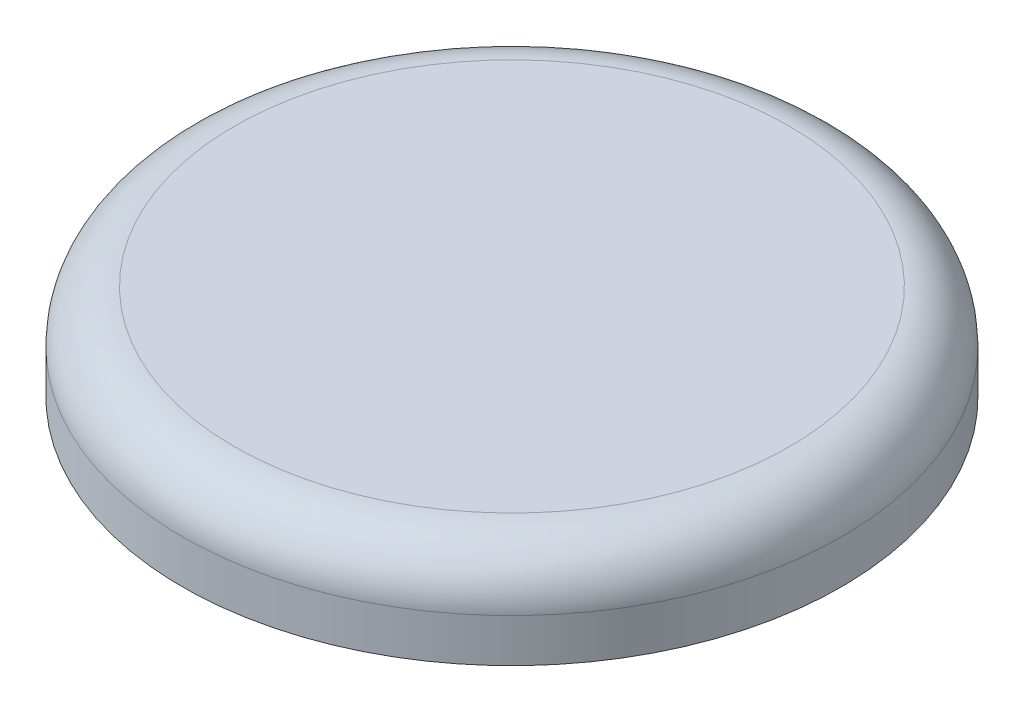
ISO-10303-21;
HEADER;
FILE_DESCRIPTION(('STEP AP214'),'2;1');
FILE_NAME('part.step','',(''),(''),'','','');
FILE_SCHEMA(('AUTOMOTIVE_DESIGN { 1 0 10303 214 1 1 1 1 }'));
ENDSEC;
DATA;
#1=APPLICATION_CONTEXT('core data for automotive mechanical design processes');
#2=APPLICATION_PROTOCOL_DEFINITION('international standard','automotive_design',2000,#1);
#3=PRODUCT_CONTEXT('',#1,'mechanical');
#4=PRODUCT('Part','Part','',(#3));
#5=PRODUCT_RELATED_PRODUCT_CATEGORY('part','',(#4));
#6=PRODUCT_DEFINITION_FORMATION('','',#4);
#7=PRODUCT_DEFINITION_CONTEXT('part definition',#1,'design');
#8=PRODUCT_DEFINITION('design','',#6,#7);
#9=PRODUCT_DEFINITION_SHAPE('','',#8);
#10=(LENGTH_UNIT() NAMED_UNIT(*) SI_UNIT(.MILLI.,.METRE.));
#11=(NAMED_UNIT(*) PLANE_ANGLE_UNIT() SI_UNIT($,.RADIAN.));
#12=(NAMED_UNIT(*) SI_UNIT($,.STERADIAN.) SOLID_ANGLE_UNIT());
#13=UNCERTAINTY_MEASURE_WITH_UNIT(LENGTH_MEASURE(1.E-05),#10,'distance_accuracy_value','');
#14=(GEOMETRIC_REPRESENTATION_CONTEXT(3) GLOBAL_UNCERTAINTY_ASSIGNED_CONTEXT((#13)) GLOBAL_UNIT_ASSIGNED_CONTEXT((#10,
#11,#12)) REPRESENTATION_CONTEXT('',''));
#15=CARTESIAN_POINT('',(0.,0.,0.));
#16=DIRECTION('',(0.,0.,1.));
#17=DIRECTION('',(1.,0.,0.));
#18=AXIS2_PLACEMENT_3D('',#15,#16,#17);
#19=CARTESIAN_POINT('',(0.,0.,0.));
#20=DIRECTION('',(0.,-1.,0.));
#21=DIRECTION('',(0.,0.,-1.));
#22=AXIS2_PLACEMENT_3D('',#19,#20,#21);
#23=PLANE('',#22);
#24=CARTESIAN_POINT('',(0.,0.,0.));
#25=DIRECTION('',(0.,-1.,0.));
#26=DIRECTION('',(0.,0.,-1.));
#27=AXIS2_PLACEMENT_3D('',#24,#25,#26);
#28=CIRCLE('',#27,16.288);
#29=CARTESIAN_POINT('',(0.,0.,-16.288));
#30=VERTEX_POINT('',#29);
#31=EDGE_CURVE('E57',#30,#30,#28,.F.);
#32=ORIENTED_EDGE('',*,*,#31,.T.);
#33=EDGE_LOOP('',(#32));
#34=FACE_BOUND('',#33,.T.);
#35=ADVANCED_FACE('F37',(#34),#23,.F.);
#36=CARTESIAN_POINT('',(0.,0.,0.));
#37=DIRECTION('',(0.,-1.,0.));
#38=DIRECTION('',(0.,0.,-1.));
#39=AXIS2_PLACEMENT_3D('',#36,#37,#38);
#40=CYLINDRICAL_SURFACE('',#39,19.342);
#41=CARTESIAN_POINT('',(0.,-3.054,0.));
#42=DIRECTION('',(0.,-1.,0.));
#43=DIRECTION('',(0.,0.,-1.));
#44=AXIS2_PLACEMENT_3D('',#41,#42,#43);
#45=CIRCLE('',#44,19.342);
#46=CARTESIAN_POINT('',(0.,-3.054,-19.342));
#47=VERTEX_POINT('',#46);
#48=EDGE_CURVE('E60',#47,#47,#45,.T.);
#49=ORIENTED_EDGE('',*,*,#48,.T.);
#50=EDGE_LOOP('',(#49));
#51=FACE_BOUND('',#50,.T.);
#52=CARTESIAN_POINT('',(0.,-5.599,0.));
#53=DIRECTION('',(0.,-1.,0.));
#54=DIRECTION('',(0.,0.,-1.));
#55=AXIS2_PLACEMENT_3D('',#52,#53,#54);
#56=CIRCLE('',#55,19.342);
#57=CARTESIAN_POINT('',(0.,-5.599,-19.342));
#58=VERTEX_POINT('',#57);
#59=EDGE_CURVE('E63',#58,#58,#56,.T.);
#60=ORIENTED_EDGE('',*,*,#59,.F.);
#61=EDGE_LOOP('',(#60));
#62=FACE_BOUND('',#61,.T.);
#63=ADVANCED_FACE('F103',(#51,#62),#40,.T.);
#64=CARTESIAN_POINT('',(-19.342,-5.599,0.));
#65=DIRECTION('',(0.,1.,0.));
#66=DIRECTION('',(0.,0.,1.));
#67=AXIS2_PLACEMENT_3D('',#64,#65,#66);
#68=PLANE('',#67);
#69=CARTESIAN_POINT('',(0.,-5.599,0.));
#70=DIRECTION('',(0.,-1.,0.));
#71=DIRECTION('',(0.,0.,-1.));
#72=AXIS2_PLACEMENT_3D('',#69,#70,#71);
#73=CIRCLE('',#72,16.797);
#74=CARTESIAN_POINT('',(0.,-5.599,-16.797));
#75=VERTEX_POINT('',#74);
#76=EDGE_CURVE('E66',#75,#75,#73,.T.);
#77=ORIENTED_EDGE('',*,*,#76,.F.);
#78=EDGE_LOOP('',(#77));
#79=FACE_BOUND('',#78,.T.);
#80=ORIENTED_EDGE('',*,*,#59,.T.);
#81=EDGE_LOOP('',(#80));
#82=FACE_BOUND('',#81,.T.);
#83=ADVANCED_FACE('F109',(#79,#82),#68,.F.);
#84=CARTESIAN_POINT('',(0.,-5.599,0.));
#85=DIRECTION('',(0.,-1.,0.));
#86=DIRECTION('',(0.,0.,-1.));
#87=AXIS2_PLACEMENT_3D('',#84,#85,#86);
#88=CONICAL_SURFACE('',#87,16.797,0.0872664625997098);
#89=CARTESIAN_POINT('',(0.,-2.96527545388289,0.));
#90=DIRECTION('',(0.,-1.,0.));
#91=DIRECTION('',(0.,0.,-1.));
#92=AXIS2_PLACEMENT_3D('',#89,#90,#91);
#93=CIRCLE('',#92,16.5665789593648);
#94=CARTESIAN_POINT('',(0.,-2.96527545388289,-16.5665789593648));
#95=VERTEX_POINT('',#94);
#96=EDGE_CURVE('E44',#95,#95,#93,.F.);
#97=ORIENTED_EDGE('',*,*,#96,.T.);
#98=EDGE_LOOP('',(#97));
#99=FACE_BOUND('',#98,.T.);
#100=ORIENTED_EDGE('',*,*,#76,.T.);
#101=EDGE_LOOP('',(#100));
#102=FACE_BOUND('',#101,.T.);
#103=ADVANCED_FACE('F131',(#99,#102),#88,.F.);
#104=CARTESIAN_POINT('',(-16.4852778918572,-2.036,0.));
#105=DIRECTION('',(0.,1.,0.));
#106=DIRECTION('',(0.,0.,1.));
#107=AXIS2_PLACEMENT_3D('',#104,#105,#106);
#108=PLANE('',#107);
#109=CARTESIAN_POINT('',(0.,-2.036,0.));
#110=DIRECTION('',(0.,1.,0.));
#111=DIRECTION('',(0.,0.,1.));
#112=AXIS2_PLACEMENT_3D('',#109,#110,#111);
#113=CIRCLE('',#112,15.5524527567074);
#114=CARTESIAN_POINT('',(0.,-2.036,15.5524527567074));
#115=VERTEX_POINT('',#114);
#116=EDGE_CURVE('E48',#115,#115,#113,.F.);
#117=ORIENTED_EDGE('',*,*,#116,.T.);
#118=EDGE_LOOP('',(#117));
#119=FACE_BOUND('',#118,.T.);
#120=CARTESIAN_POINT('',(0.,-2.036,0.));
#121=DIRECTION('',(0.,1.,0.));
#122=DIRECTION('',(0.,0.,1.));
#123=AXIS2_PLACEMENT_3D('',#120,#121,#122);
#124=CIRCLE('',#123,10.689);
#125=CARTESIAN_POINT('',(0.,-2.036,10.689));
#126=VERTEX_POINT('',#125);
#127=EDGE_CURVE('E52',#126,#126,#124,.T.);
#128=ORIENTED_EDGE('',*,*,#127,.T.);
#129=EDGE_LOOP('',(#128));
#130=FACE_BOUND('',#129,.T.);
#131=ADVANCED_FACE('F127',(#119,#130),#108,.F.);
#132=CARTESIAN_POINT('',(0.,0.,0.));
#133=DIRECTION('',(0.,-1.,0.));
#134=DIRECTION('',(0.,0.,-1.));
#135=AXIS2_PLACEMENT_3D('',#132,#133,#134);
#136=CYLINDRICAL_SURFACE('',#135,9.671);
#137=CARTESIAN_POINT('',(0.,-3.054,0.));
#138=DIRECTION('',(0.,1.,0.));
#139=DIRECTION('',(0.,0.,1.));
#140=AXIS2_PLACEMENT_3D('',#137,#138,#139);
#141=CIRCLE('',#140,9.671);
#142=CARTESIAN_POINT('',(0.,-3.054,9.671));
#143=VERTEX_POINT('',#142);
#144=EDGE_CURVE('E10',#143,#143,#141,.F.);
#145=ORIENTED_EDGE('',*,*,#144,.T.);
#146=EDGE_LOOP('',(#145));
#147=FACE_BOUND('',#146,.T.);
#148=CARTESIAN_POINT('',(0.,-12.216,0.));
#149=DIRECTION('',(0.,-1.,0.));
#150=DIRECTION('',(0.,0.,-1.));
#151=AXIS2_PLACEMENT_3D('',#148,#149,#150);
#152=CIRCLE('',#151,9.671);
#153=CARTESIAN_POINT('',(0.,-12.216,-9.671));
#154=VERTEX_POINT('',#153);
#155=EDGE_CURVE('E69',#154,#154,#152,.T.);
#156=ORIENTED_EDGE('',*,*,#155,.F.);
#157=EDGE_LOOP('',(#156));
#158=FACE_BOUND('',#157,.T.);
#159=ADVANCED_FACE('F130',(#147,#158),#136,.T.);
#160=CARTESIAN_POINT('',(-9.671,-12.216,0.));
#161=DIRECTION('',(0.,1.,0.));
#162=DIRECTION('',(0.,0.,1.));
#163=AXIS2_PLACEMENT_3D('',#160,#161,#162);
#164=PLANE('',#163);
#165=CARTESIAN_POINT('',(0.,-12.216,0.));
#166=DIRECTION('',(0.,-1.,0.));
#167=DIRECTION('',(0.,0.,-1.));
#168=AXIS2_PLACEMENT_3D('',#165,#166,#167);
#169=CIRCLE('',#168,7.76225);
#170=CARTESIAN_POINT('',(0.,-12.216,-7.76225));
#171=VERTEX_POINT('',#170);
#172=EDGE_CURVE('E72',#171,#171,#169,.T.);
#173=ORIENTED_EDGE('',*,*,#172,.F.);
#174=EDGE_LOOP('',(#173));
#175=FACE_BOUND('',#174,.T.);
#176=ORIENTED_EDGE('',*,*,#155,.T.);
#177=EDGE_LOOP('',(#176));
#178=FACE_BOUND('',#177,.T.);
#179=ADVANCED_FACE('F139',(#175,#178),#164,.F.);
#180=CARTESIAN_POINT('',(0.,-12.216,0.));
#181=DIRECTION('',(0.,-1.,0.));
#182=DIRECTION('',(0.,0.,-1.));
#183=AXIS2_PLACEMENT_3D('',#180,#181,#182);
#184=CONICAL_SURFACE('',#183,7.76225,0.0436332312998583);
#185=CARTESIAN_POINT('',(0.,-7.58881698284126,0.));
#186=DIRECTION('',(0.,1.,0.));
#187=DIRECTION('',(0.,0.,1.));
#188=AXIS2_PLACEMENT_3D('',#185,#186,#187);
#189=CIRCLE('',#188,7.56022282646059);
#190=CARTESIAN_POINT('',(0.,-7.58881698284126,7.56022282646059));
#191=VERTEX_POINT('',#190);
#192=EDGE_CURVE('E78',#191,#191,#189,.T.);
#193=ORIENTED_EDGE('',*,*,#192,.T.);
#194=EDGE_LOOP('',(#193));
#195=FACE_BOUND('',#194,.T.);
#196=ORIENTED_EDGE('',*,*,#172,.T.);
#197=EDGE_LOOP('',(#196));
#198=FACE_BOUND('',#197,.T.);
#199=ADVANCED_FACE('F92',(#195,#198),#184,.F.);
#200=CARTESIAN_POINT('',(0.,-3.054,0.));
#201=DIRECTION('',(0.,-1.,0.));
#202=DIRECTION('',(0.,0.,-1.));
#203=AXIS2_PLACEMENT_3D('',#200,#201,#202);
#204=TOROIDAL_SURFACE('',#203,16.288,3.054);
#205=ORIENTED_EDGE('',*,*,#31,.F.);
#206=EDGE_LOOP('',(#205));
#207=FACE_BOUND('',#206,.T.);
#208=ORIENTED_EDGE('',*,*,#48,.F.);
#209=EDGE_LOOP('',(#208));
#210=FACE_BOUND('',#209,.T.);
#211=ADVANCED_FACE('F114',(#207,#210),#204,.T.);
#212=CARTESIAN_POINT('',(0.,-3.054,0.));
#213=DIRECTION('',(0.,1.,0.));
#214=DIRECTION('',(0.,0.,1.));
#215=AXIS2_PLACEMENT_3D('',#212,#213,#214);
#216=TOROIDAL_SURFACE('',#215,15.5524527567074,1.018);
#217=ORIENTED_EDGE('',*,*,#96,.F.);
#218=EDGE_LOOP('',(#217));
#219=FACE_BOUND('',#218,.T.);
#220=ORIENTED_EDGE('',*,*,#116,.F.);
#221=EDGE_LOOP('',(#220));
#222=FACE_BOUND('',#221,.T.);
#223=ADVANCED_FACE('F116',(#219,#222),#216,.F.);
#224=CARTESIAN_POINT('',(0.,-3.054,0.));
#225=DIRECTION('',(0.,1.,0.));
#226=DIRECTION('',(0.,0.,1.));
#227=AXIS2_PLACEMENT_3D('',#224,#225,#226);
#228=TOROIDAL_SURFACE('',#227,10.689,1.018);
#229=ORIENTED_EDGE('',*,*,#127,.F.);
#230=EDGE_LOOP('',(#229));
#231=FACE_BOUND('',#230,.T.);
#232=ORIENTED_EDGE('',*,*,#144,.F.);
#233=EDGE_LOOP('',(#232));
#234=FACE_BOUND('',#233,.T.);
#235=ADVANCED_FACE('F39',(#231,#234),#228,.F.);
#236=CARTESIAN_POINT('',(0.,-7.126,0.));
#237=DIRECTION('',(0.,1.,0.));
#238=DIRECTION('',(0.,0.,1.));
#239=AXIS2_PLACEMENT_3D('',#236,#237,#238);
#240=TOROIDAL_SURFACE('',#239,6.65351204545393,1.018);
#241=ORIENTED_EDGE('',*,*,#192,.F.);
#242=EDGE_LOOP('',(#241));
#243=FACE_BOUND('',#242,.T.);
#244=CARTESIAN_POINT('',(0.,-6.58591912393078,0.));
#245=DIRECTION('',(0.,1.,0.));
#246=DIRECTION('',(0.,0.,1.));
#247=AXIS2_PLACEMENT_3D('',#244,#245,#246);
#248=CIRCLE('',#247,7.51643536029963);
#249=CARTESIAN_POINT('',(0.,-6.58591912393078,7.51643536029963));
#250=VERTEX_POINT('',#249);
#251=EDGE_CURVE('E81',#250,#250,#248,.T.);
#252=ORIENTED_EDGE('',*,*,#251,.T.);
#253=EDGE_LOOP('',(#252));
#254=FACE_BOUND('',#253,.T.);
#255=ADVANCED_FACE('F85',(#243,#254),#240,.F.);
#256=CARTESIAN_POINT('',(-7.31778160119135,-2.036,0.));
#257=DIRECTION('',(0.,1.,0.));
#258=DIRECTION('',(0.,0.,1.));
#259=AXIS2_PLACEMENT_3D('',#256,#257,#258);
#260=PLANE('',#259);
#261=CARTESIAN_POINT('',(0.,-2.036,0.));
#262=DIRECTION('',(0.,-1.,0.));
#263=DIRECTION('',(0.,0.,-1.));
#264=AXIS2_PLACEMENT_3D('',#261,#262,#263);
#265=CIRCLE('',#264,7.31778160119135);
#266=CARTESIAN_POINT('',(0.,-2.036,-7.31778160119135));
#267=VERTEX_POINT('',#266);
#268=EDGE_CURVE('E75',#267,#267,#265,.T.);
#269=ORIENTED_EDGE('',*,*,#268,.T.);
#270=EDGE_LOOP('',(#269));
#271=FACE_BOUND('',#270,.T.);
#272=ADVANCED_FACE('F90',(#271),#260,.F.);
#273=ORIENTED_EDGE('',*,*,#251,.F.);
#274=EDGE_LOOP('',(#273));
#275=FACE_BOUND('',#274,.T.);
#276=ORIENTED_EDGE('',*,*,#268,.F.);
#277=EDGE_LOOP('',(#276));
#278=FACE_BOUND('',#277,.T.);
#279=ADVANCED_FACE('F87',(#275,#278),#184,.F.);
#280=CLOSED_SHELL('',(#35,#63,#83,#103,#131,#159,#179,#199,#211,#223,#235,#255,#272,#279));
#281=MANIFOLD_SOLID_BREP('B2',#280);
#282=ADVANCED_BREP_SHAPE_REPRESENTATION('',(#18,#281),#14);
#283=SHAPE_DEFINITION_REPRESENTATION(#9,#282);
ENDSEC;
END-ISO-10303-21;
